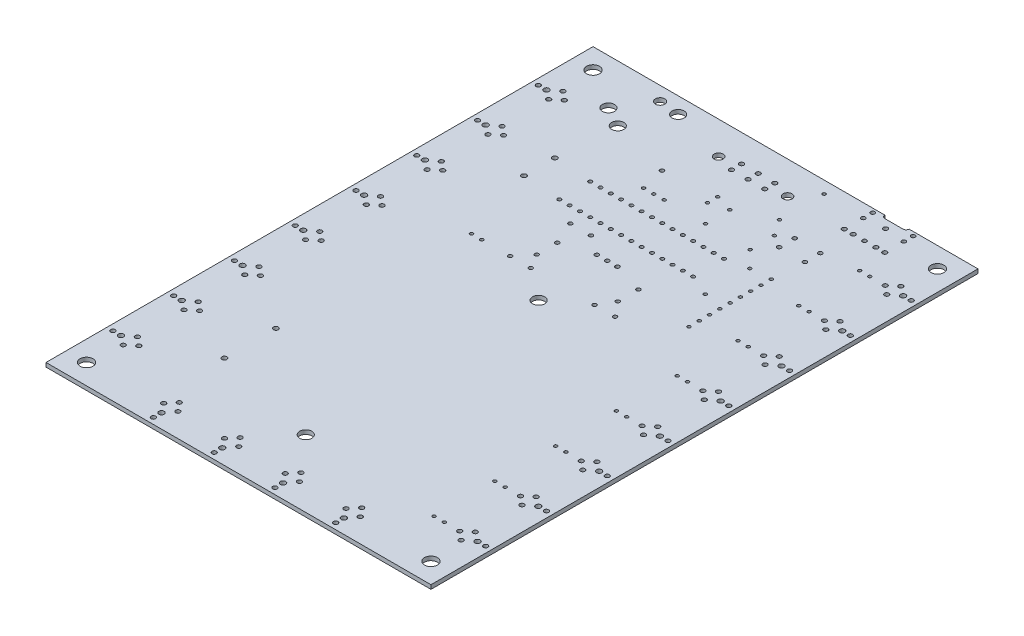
from build123d import *

# Parameters (mm, degrees)
ESQUISSE1_R      = 0.55118
ESQUISSE1_R_2    = 0.65024
ESQUISSE1_R_3    = 0.59944
ESQUISSE1_R_4    = 1.50114
ESQUISSE1_R_5    = 0.50038
ESQUISSE1_R_6    = 0.4826
ESQUISSE1_R_7    = 1.15062
ESQUISSE1_R_8    = 1.6002
ESQUISSE1_R_9    = 0.44958
ESQUISSE1_R_10   = 0.39878
ESQUISSE1_R_11   = 1.09982
EXTRUSION1_DEPTH = 1


with BuildPart() as part:
    # Esquisse1 → Extrusion1 (new body)
    with BuildSketch(Plane(origin=(0, 0, 0), x_dir=(1, 0, 0), z_dir=(0, 1, 0))):
        with BuildLine():
            Line((72.74814, 134.2517), (77.24902, 134.2517))
            ThreePointArc((77.24902, 134.2517), (77.77850144, 134.470811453), (77.998319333, 135))
            Line((77.998319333, 135), (95, 135))
            Line((95, 135), (95, 0))
            Line((95, 0), (0, 0))
            Line((0, 0), (0, 135))
            Line((0, 135), (71.998840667, 135))
            ThreePointArc((71.998840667, 135), (72.21865856, 134.470811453), (72.74814, 134.2517))
        make_face()
        with Locations(Location((24.99868, 1.4986, 0), (0, 0, 270))):
            Circle(ESQUISSE1_R, mode=Mode.SUBTRACT)
        with Locations(Location((24.99868, 7.8994, 0), (0, 0, 270))):
            Circle(ESQUISSE1_R, mode=Mode.SUBTRACT)
        with Locations(Location((26.74874, 5.79882, 0), (0, 0, 270))):
            Circle(ESQUISSE1_R, mode=Mode.SUBTRACT)
        with Locations(Location((23.24862, 5.79882, 0), (0, 0, 270))):
            Circle(ESQUISSE1_R, mode=Mode.SUBTRACT)
        with Locations(Location((24.99868, 3.50012, 0), (0, 0, 270))):
            Circle(ESQUISSE1_R_2, mode=Mode.SUBTRACT)
        with Locations(Location((39.99992, 1.4986, 0), (0, 0, 270))):
            Circle(ESQUISSE1_R, mode=Mode.SUBTRACT)
        with Locations(Location((39.99992, 7.8994, 0), (0, 0, 270))):
            Circle(ESQUISSE1_R, mode=Mode.SUBTRACT)
        with Locations(Location((41.74998, 5.79882, 0), (0, 0, 270))):
            Circle(ESQUISSE1_R, mode=Mode.SUBTRACT)
        with Locations(Location((38.24986, 5.79882, 0), (0, 0, 270))):
            Circle(ESQUISSE1_R, mode=Mode.SUBTRACT)
        with Locations(Location((39.99992, 3.50012, 0), (0, 0, 270))):
            Circle(ESQUISSE1_R_2, mode=Mode.SUBTRACT)
        with Locations(Location((54.99862, 1.4986, 0), (0, 0, 270))):
            Circle(ESQUISSE1_R, mode=Mode.SUBTRACT)
        with Locations(Location((54.99862, 7.8994, 0), (0, 0, 270))):
            Circle(ESQUISSE1_R, mode=Mode.SUBTRACT)
        with Locations(Location((56.74868, 5.79882, 0), (0, 0, 270))):
            Circle(ESQUISSE1_R, mode=Mode.SUBTRACT)
        with Locations(Location((53.24856, 5.79882, 0), (0, 0, 270))):
            Circle(ESQUISSE1_R, mode=Mode.SUBTRACT)
        with Locations(Location((54.99862, 3.50012, 0), (0, 0, 270))):
            Circle(ESQUISSE1_R_2, mode=Mode.SUBTRACT)
        with Locations(Location((69.99986, 1.4986, 0), (0, 0, 270))):
            Circle(ESQUISSE1_R, mode=Mode.SUBTRACT)
        with Locations(Location((69.99986, 7.8994, 0), (0, 0, 270))):
            Circle(ESQUISSE1_R, mode=Mode.SUBTRACT)
        with Locations(Location((71.74992, 5.79882, 0), (0, 0, 270))):
            Circle(ESQUISSE1_R, mode=Mode.SUBTRACT)
        with Locations(Location((68.2498, 5.79882, 0), (0, 0, 270))):
            Circle(ESQUISSE1_R, mode=Mode.SUBTRACT)
        with Locations(Location((69.99986, 3.50012, 0), (0, 0, 270))):
            Circle(ESQUISSE1_R_2, mode=Mode.SUBTRACT)
        with Locations(Location((21.07946, 35.6489, 0), (0, 0, 270))):
            Circle(ESQUISSE1_R_3, mode=Mode.SUBTRACT)
        with Locations(Location((21.07946, 22.9489, 0), (0, 0, 270))):
            Circle(ESQUISSE1_R_3, mode=Mode.SUBTRACT)
        with Locations(Location((47.50054, 16.5989, 0), (0, 0, 270))):
            Circle(ESQUISSE1_R_4, mode=Mode.SUBTRACT)
        with Locations(Location((72.1741, 118.90502, 0), (0, 0, 270))):
            Circle(ESQUISSE1_R_5, mode=Mode.SUBTRACT)
        with Locations(Location((72.1741, 115.09502, 0), (0, 0, 270))):
            Circle(ESQUISSE1_R_5, mode=Mode.SUBTRACT)
        with Locations(Location((65.8241, 115.09502, 0), (0, 0, 270))):
            Circle(ESQUISSE1_R_5, mode=Mode.SUBTRACT)
        with Locations(Location((65.8241, 118.90502, 0), (0, 0, 270))):
            Circle(ESQUISSE1_R_5, mode=Mode.SUBTRACT)
        with Locations(Location((40.0939, 94.3864, 0), (0, 0, 270))):
            Circle(ESQUISSE1_R_6, mode=Mode.SUBTRACT)
        with Locations(Location((35.0139, 94.3864, 0), (0, 0, 270))):
            Circle(ESQUISSE1_R_6, mode=Mode.SUBTRACT)
        with Locations(Location((60.452, 79.99222, 0), (0, 0, 270))):
            Circle(ESQUISSE1_R_6, mode=Mode.SUBTRACT)
        with Locations(Location((55.372, 79.99222, 0), (0, 0, 270))):
            Circle(ESQUISSE1_R_6, mode=Mode.SUBTRACT)
        with Locations(Location((34.54654, 80.00746, 0), (0, 0, 270))):
            Circle(ESQUISSE1_R_6, mode=Mode.SUBTRACT)
        with Locations(Location((39.62654, 80.00746, 0), (0, 0, 270))):
            Circle(ESQUISSE1_R_6, mode=Mode.SUBTRACT)
        with Locations(Location((57.50052, 83.59902, 0), (0, 0, 270))):
            Circle(ESQUISSE1_R_6, mode=Mode.SUBTRACT)
        with Locations(Location((57.50052, 88.67902, 0), (0, 0, 270))):
            Circle(ESQUISSE1_R_6, mode=Mode.SUBTRACT)
        with Locations(Location((37.50056, 83.59902, 0), (0, 0, 270))):
            Circle(ESQUISSE1_R_6, mode=Mode.SUBTRACT)
        with Locations(Location((37.50056, 88.67902, 0), (0, 0, 270))):
            Circle(ESQUISSE1_R_6, mode=Mode.SUBTRACT)
        with Locations(Location((19.99996, 121.09958, 0), (0, 0, 270))):
            Circle(ESQUISSE1_R_4, mode=Mode.SUBTRACT)
        with Locations(Location((15.00124, 123.7996, 0), (0, 0, 270))):
            Circle(ESQUISSE1_R_4, mode=Mode.SUBTRACT)
        with Locations(Location((25.00122, 131.0005, 0), (0, 0, 270))):
            Circle(ESQUISSE1_R_4, mode=Mode.SUBTRACT)
        with Locations(Location((19.99996, 131.54914, 0), (0, 0, 270))):
            Circle(ESQUISSE1_R_7, mode=Mode.SUBTRACT)
        with Locations(Location((19.07032, 98.8822, 0), (0, 0, 270))):
            Circle(ESQUISSE1_R_3, mode=Mode.SUBTRACT)
        with Locations(Location((19.07032, 106.5022, 0), (0, 0, 270))):
            Circle(ESQUISSE1_R_3, mode=Mode.SUBTRACT)
        with Locations(Location((5.00126, 5.00126, 0), (0, 0, 270))):
            Circle(ESQUISSE1_R_8, mode=Mode.SUBTRACT)
        with Locations(Location((5.00126, 129.99974, 0), (0, 0, 270))):
            Circle(ESQUISSE1_R_8, mode=Mode.SUBTRACT)
        with Locations(Location((89.99982, 129.99974, 0), (0, 0, 270))):
            Circle(ESQUISSE1_R_8, mode=Mode.SUBTRACT)
        with Locations(Location((89.99982, 5.00126, 0), (0, 0, 270))):
            Circle(ESQUISSE1_R_8, mode=Mode.SUBTRACT)
        with Locations(Location((61.51118, 105.80878, 0), (0, 0, 270))):
            Circle(ESQUISSE1_R_9, mode=Mode.SUBTRACT)
        with Locations(Location((58.97118, 105.80878, 0), (0, 0, 270))):
            Circle(ESQUISSE1_R_9, mode=Mode.SUBTRACT)
        with Locations(Location((56.43118, 105.80878, 0), (0, 0, 270))):
            Circle(ESQUISSE1_R_9, mode=Mode.SUBTRACT)
        with Locations(Location((53.89118, 105.80878, 0), (0, 0, 270))):
            Circle(ESQUISSE1_R_9, mode=Mode.SUBTRACT)
        with Locations(Location((51.35118, 105.80878, 0), (0, 0, 270))):
            Circle(ESQUISSE1_R_9, mode=Mode.SUBTRACT)
        with Locations(Location((48.81118, 105.80878, 0), (0, 0, 270))):
            Circle(ESQUISSE1_R_9, mode=Mode.SUBTRACT)
        with Locations(Location((46.27118, 105.80878, 0), (0, 0, 270))):
            Circle(ESQUISSE1_R_9, mode=Mode.SUBTRACT)
        with Locations(Location((43.73118, 105.80878, 0), (0, 0, 270))):
            Circle(ESQUISSE1_R_9, mode=Mode.SUBTRACT)
        with Locations(Location((41.19118, 105.80878, 0), (0, 0, 270))):
            Circle(ESQUISSE1_R_9, mode=Mode.SUBTRACT)
        with Locations(Location((38.65118, 105.80878, 0), (0, 0, 270))):
            Circle(ESQUISSE1_R_9, mode=Mode.SUBTRACT)
        with Locations(Location((36.11118, 105.80878, 0), (0, 0, 270))):
            Circle(ESQUISSE1_R_9, mode=Mode.SUBTRACT)
        with Locations(Location((33.57118, 105.80878, 0), (0, 0, 270))):
            Circle(ESQUISSE1_R_9, mode=Mode.SUBTRACT)
        with Locations(Location((31.03118, 105.80878, 0), (0, 0, 270))):
            Circle(ESQUISSE1_R_9, mode=Mode.SUBTRACT)
        with Locations(Location((28.49118, 105.80878, 0), (0, 0, 270))):
            Circle(ESQUISSE1_R_9, mode=Mode.SUBTRACT)
        with Locations(Location((28.49118, 98.18878, 0), (0, 0, 270))):
            Circle(ESQUISSE1_R_9, mode=Mode.SUBTRACT)
        with Locations(Location((31.03118, 98.18878, 0), (0, 0, 270))):
            Circle(ESQUISSE1_R_9, mode=Mode.SUBTRACT)
        with Locations(Location((33.57118, 98.18878, 0), (0, 0, 270))):
            Circle(ESQUISSE1_R_9, mode=Mode.SUBTRACT)
        with Locations(Location((36.11118, 98.18878, 0), (0, 0, 270))):
            Circle(ESQUISSE1_R_9, mode=Mode.SUBTRACT)
        with Locations(Location((38.65118, 98.18878, 0), (0, 0, 270))):
            Circle(ESQUISSE1_R_9, mode=Mode.SUBTRACT)
        with Locations(Location((41.19118, 98.18878, 0), (0, 0, 270))):
            Circle(ESQUISSE1_R_9, mode=Mode.SUBTRACT)
        with Locations(Location((43.73118, 98.18878, 0), (0, 0, 270))):
            Circle(ESQUISSE1_R_9, mode=Mode.SUBTRACT)
        with Locations(Location((46.27118, 98.18878, 0), (0, 0, 270))):
            Circle(ESQUISSE1_R_9, mode=Mode.SUBTRACT)
        with Locations(Location((48.81118, 98.18878, 0), (0, 0, 270))):
            Circle(ESQUISSE1_R_9, mode=Mode.SUBTRACT)
        with Locations(Location((51.35118, 98.18878, 0), (0, 0, 270))):
            Circle(ESQUISSE1_R_9, mode=Mode.SUBTRACT)
        with Locations(Location((53.89118, 98.18878, 0), (0, 0, 270))):
            Circle(ESQUISSE1_R_9, mode=Mode.SUBTRACT)
        with Locations(Location((56.43118, 98.18878, 0), (0, 0, 270))):
            Circle(ESQUISSE1_R_9, mode=Mode.SUBTRACT)
        with Locations(Location((58.97118, 98.18878, 0), (0, 0, 270))):
            Circle(ESQUISSE1_R_9, mode=Mode.SUBTRACT)
        with Locations(Location((61.51118, 98.18878, 0), (0, 0, 270))):
            Circle(ESQUISSE1_R_9, mode=Mode.SUBTRACT)
        with Locations(Location((1.4986, 15.00124, 0), (0, 0, 270))):
            Circle(ESQUISSE1_R, mode=Mode.SUBTRACT)
        with Locations(Location((7.8994, 15.00124, 0), (0, 0, 270))):
            Circle(ESQUISSE1_R, mode=Mode.SUBTRACT)
        with Locations(Location((5.79882, 13.25118, 0), (0, 0, 270))):
            Circle(ESQUISSE1_R, mode=Mode.SUBTRACT)
        with Locations(Location((5.79882, 16.7513, 0), (0, 0, 270))):
            Circle(ESQUISSE1_R, mode=Mode.SUBTRACT)
        with Locations(Location((3.50012, 15.00124, 0), (0, 0, 270))):
            Circle(ESQUISSE1_R_2, mode=Mode.SUBTRACT)
        with Locations(Location((1.4986, 29.99994, 0), (0, 0, 270))):
            Circle(ESQUISSE1_R, mode=Mode.SUBTRACT)
        with Locations(Location((7.8994, 29.99994, 0), (0, 0, 270))):
            Circle(ESQUISSE1_R, mode=Mode.SUBTRACT)
        with Locations(Location((5.79882, 28.24988, 0), (0, 0, 270))):
            Circle(ESQUISSE1_R, mode=Mode.SUBTRACT)
        with Locations(Location((5.79882, 31.75, 0), (0, 0, 270))):
            Circle(ESQUISSE1_R, mode=Mode.SUBTRACT)
        with Locations(Location((3.50012, 30.00248, 0), (0, 0, 270))):
            Circle(ESQUISSE1_R_2, mode=Mode.SUBTRACT)
        with Locations(Location((1.4986, 45.00118, 0), (0, 0, 270))):
            Circle(ESQUISSE1_R, mode=Mode.SUBTRACT)
        with Locations(Location((7.8994, 45.00118, 0), (0, 0, 270))):
            Circle(ESQUISSE1_R, mode=Mode.SUBTRACT)
        with Locations(Location((5.79882, 43.25112, 0), (0, 0, 270))):
            Circle(ESQUISSE1_R, mode=Mode.SUBTRACT)
        with Locations(Location((5.79882, 46.75124, 0), (0, 0, 270))):
            Circle(ESQUISSE1_R, mode=Mode.SUBTRACT)
        with Locations(Location((3.50012, 45.00118, 0), (0, 0, 270))):
            Circle(ESQUISSE1_R_2, mode=Mode.SUBTRACT)
        with Locations(Location((1.4986, 59.99988, 0), (0, 0, 270))):
            Circle(ESQUISSE1_R, mode=Mode.SUBTRACT)
        with Locations(Location((7.8994, 59.99988, 0), (0, 0, 270))):
            Circle(ESQUISSE1_R, mode=Mode.SUBTRACT)
        with Locations(Location((5.79882, 58.24982, 0), (0, 0, 270))):
            Circle(ESQUISSE1_R, mode=Mode.SUBTRACT)
        with Locations(Location((5.79882, 61.74994, 0), (0, 0, 270))):
            Circle(ESQUISSE1_R, mode=Mode.SUBTRACT)
        with Locations(Location((3.50012, 60.00242, 0), (0, 0, 270))):
            Circle(ESQUISSE1_R_2, mode=Mode.SUBTRACT)
        with Locations(Location((1.4986, 75.00112, 0), (0, 0, 270))):
            Circle(ESQUISSE1_R, mode=Mode.SUBTRACT)
        with Locations(Location((7.8994, 75.00112, 0), (0, 0, 270))):
            Circle(ESQUISSE1_R, mode=Mode.SUBTRACT)
        with Locations(Location((5.79882, 73.25106, 0), (0, 0, 270))):
            Circle(ESQUISSE1_R, mode=Mode.SUBTRACT)
        with Locations(Location((5.79882, 76.75118, 0), (0, 0, 270))):
            Circle(ESQUISSE1_R, mode=Mode.SUBTRACT)
        with Locations(Location((3.50012, 75.00112, 0), (0, 0, 270))):
            Circle(ESQUISSE1_R_2, mode=Mode.SUBTRACT)
        with Locations(Location((1.4986, 89.99982, 0), (0, 0, 270))):
            Circle(ESQUISSE1_R, mode=Mode.SUBTRACT)
        with Locations(Location((7.8994, 89.99982, 0), (0, 0, 270))):
            Circle(ESQUISSE1_R, mode=Mode.SUBTRACT)
        with Locations(Location((5.79882, 88.24976, 0), (0, 0, 270))):
            Circle(ESQUISSE1_R, mode=Mode.SUBTRACT)
        with Locations(Location((5.79882, 91.74988, 0), (0, 0, 270))):
            Circle(ESQUISSE1_R, mode=Mode.SUBTRACT)
        with Locations(Location((3.50012, 90.00236, 0), (0, 0, 270))):
            Circle(ESQUISSE1_R_2, mode=Mode.SUBTRACT)
        with Locations(Location((1.4986, 105.00106, 0), (0, 0, 270))):
            Circle(ESQUISSE1_R, mode=Mode.SUBTRACT)
        with Locations(Location((7.8994, 105.00106, 0), (0, 0, 270))):
            Circle(ESQUISSE1_R, mode=Mode.SUBTRACT)
        with Locations(Location((5.79882, 103.251, 0), (0, 0, 270))):
            Circle(ESQUISSE1_R, mode=Mode.SUBTRACT)
        with Locations(Location((5.79882, 106.75112, 0), (0, 0, 270))):
            Circle(ESQUISSE1_R, mode=Mode.SUBTRACT)
        with Locations(Location((3.50012, 105.00106, 0), (0, 0, 270))):
            Circle(ESQUISSE1_R_2, mode=Mode.SUBTRACT)
        with Locations(Location((1.4986, 119.99976, 0), (0, 0, 270))):
            Circle(ESQUISSE1_R, mode=Mode.SUBTRACT)
        with Locations(Location((7.8994, 119.99976, 0), (0, 0, 270))):
            Circle(ESQUISSE1_R, mode=Mode.SUBTRACT)
        with Locations(Location((5.79882, 118.25224, 0), (0, 0, 270))):
            Circle(ESQUISSE1_R, mode=Mode.SUBTRACT)
        with Locations(Location((5.79882, 121.74982, 0), (0, 0, 270))):
            Circle(ESQUISSE1_R, mode=Mode.SUBTRACT)
        with Locations(Location((3.50012, 120.0023, 0), (0, 0, 270))):
            Circle(ESQUISSE1_R_2, mode=Mode.SUBTRACT)
        with Locations(Location((25.00122, 79.99984, 0), (0, 0, 270))):
            Circle(ESQUISSE1_R_10, mode=Mode.SUBTRACT)
        with Locations(Location((27.54122, 79.99984, 0), (0, 0, 270))):
            Circle(ESQUISSE1_R_10, mode=Mode.SUBTRACT)
        with Locations(Location((74.99858, 132.19176, 0), (0, 0, 270))):
            Circle(ESQUISSE1_R, mode=Mode.SUBTRACT)
        with Locations(Location((79.9973, 126.99238, 0), (0, 0, 270))):
            Circle(ESQUISSE1_R, mode=Mode.SUBTRACT)
        with Locations(Location((77.79766, 126.99238, 0), (0, 0, 270))):
            Circle(ESQUISSE1_R, mode=Mode.SUBTRACT)
        with Locations(Location((72.19696, 126.99238, 0), (0, 0, 270))):
            Circle(ESQUISSE1_R, mode=Mode.SUBTRACT)
        with Locations(Location((69.99732, 126.99238, 0), (0, 0, 270))):
            Circle(ESQUISSE1_R, mode=Mode.SUBTRACT)
        with Locations(Location((74.99858, 126.99238, 0), (0, 0, 270))):
            Circle(ESQUISSE1_R_5, mode=Mode.SUBTRACT)
        with Locations(Location((79.9973, 133.99262, 0), (0, 0, 270))):
            Circle(ESQUISSE1_R_5, mode=Mode.SUBTRACT)
        with Locations(Location((79.9973, 131.69138, 0), (0, 0, 270))):
            Circle(ESQUISSE1_R_5, mode=Mode.SUBTRACT)
        with Locations(Location((69.99732, 133.99262, 0), (0, 0, 270))):
            Circle(ESQUISSE1_R_5, mode=Mode.SUBTRACT)
        with Locations(Location((69.99732, 131.69138, 0), (0, 0, 270))):
            Circle(ESQUISSE1_R_5, mode=Mode.SUBTRACT)
        with Locations(Location((83.28914, 15.01902, 0), (0, 0, 270))):
            Circle(ESQUISSE1_R_10, mode=Mode.SUBTRACT)
        with Locations(Location((80.74914, 15.01902, 0), (0, 0, 270))):
            Circle(ESQUISSE1_R_10, mode=Mode.SUBTRACT)
        with Locations(Location((83.28914, 30.01772, 0), (0, 0, 270))):
            Circle(ESQUISSE1_R_10, mode=Mode.SUBTRACT)
        with Locations(Location((80.74914, 30.01772, 0), (0, 0, 270))):
            Circle(ESQUISSE1_R_10, mode=Mode.SUBTRACT)
        with Locations(Location((83.28914, 45.01896, 0), (0, 0, 270))):
            Circle(ESQUISSE1_R_10, mode=Mode.SUBTRACT)
        with Locations(Location((80.74914, 45.01896, 0), (0, 0, 270))):
            Circle(ESQUISSE1_R_10, mode=Mode.SUBTRACT)
        with Locations(Location((83.28914, 60.01766, 0), (0, 0, 270))):
            Circle(ESQUISSE1_R_10, mode=Mode.SUBTRACT)
        with Locations(Location((80.74914, 60.01766, 0), (0, 0, 270))):
            Circle(ESQUISSE1_R_10, mode=Mode.SUBTRACT)
        with Locations(Location((83.28914, 75.0189, 0), (0, 0, 270))):
            Circle(ESQUISSE1_R_10, mode=Mode.SUBTRACT)
        with Locations(Location((80.74914, 75.0189, 0), (0, 0, 270))):
            Circle(ESQUISSE1_R_10, mode=Mode.SUBTRACT)
        with Locations(Location((83.28914, 90.0176, 0), (0, 0, 270))):
            Circle(ESQUISSE1_R_10, mode=Mode.SUBTRACT)
        with Locations(Location((80.74914, 90.0176, 0), (0, 0, 270))):
            Circle(ESQUISSE1_R_10, mode=Mode.SUBTRACT)
        with Locations(Location((83.28914, 105.01884, 0), (0, 0, 270))):
            Circle(ESQUISSE1_R_10, mode=Mode.SUBTRACT)
        with Locations(Location((80.74914, 105.01884, 0), (0, 0, 270))):
            Circle(ESQUISSE1_R_10, mode=Mode.SUBTRACT)
        with Locations(Location((83.28914, 120.01754, 0), (0, 0, 270))):
            Circle(ESQUISSE1_R_10, mode=Mode.SUBTRACT)
        with Locations(Location((80.74914, 120.01754, 0), (0, 0, 270))):
            Circle(ESQUISSE1_R_10, mode=Mode.SUBTRACT)
        with Locations(Location((47.50054, 115.73002, 0), (0, 0, 270))):
            Circle(ESQUISSE1_R_10, mode=Mode.SUBTRACT)
        with Locations(Location((47.50054, 118.27002, 0), (0, 0, 270))):
            Circle(ESQUISSE1_R_10, mode=Mode.SUBTRACT)
        with Locations(Location((93.49994, 14.9987, 0), (0, 0, 270))):
            Circle(ESQUISSE1_R, mode=Mode.SUBTRACT)
        with Locations(Location((87.10168, 14.9987, 0), (0, 0, 270))):
            Circle(ESQUISSE1_R, mode=Mode.SUBTRACT)
        with Locations(Location((89.20226, 16.74876, 0), (0, 0, 270))):
            Circle(ESQUISSE1_R, mode=Mode.SUBTRACT)
        with Locations(Location((89.20226, 13.24864, 0), (0, 0, 270))):
            Circle(ESQUISSE1_R, mode=Mode.SUBTRACT)
        with Locations(Location((91.50096, 14.9987, 0), (0, 0, 270))):
            Circle(ESQUISSE1_R_2, mode=Mode.SUBTRACT)
        with Locations(Location((93.49994, 29.99994, 0), (0, 0, 270))):
            Circle(ESQUISSE1_R, mode=Mode.SUBTRACT)
        with Locations(Location((87.10168, 29.99994, 0), (0, 0, 270))):
            Circle(ESQUISSE1_R, mode=Mode.SUBTRACT)
        with Locations(Location((89.20226, 31.75, 0), (0, 0, 270))):
            Circle(ESQUISSE1_R, mode=Mode.SUBTRACT)
        with Locations(Location((89.20226, 28.24988, 0), (0, 0, 270))):
            Circle(ESQUISSE1_R, mode=Mode.SUBTRACT)
        with Locations(Location((91.50096, 29.99994, 0), (0, 0, 270))):
            Circle(ESQUISSE1_R_2, mode=Mode.SUBTRACT)
        with Locations(Location((93.49994, 44.99864, 0), (0, 0, 270))):
            Circle(ESQUISSE1_R, mode=Mode.SUBTRACT)
        with Locations(Location((87.10168, 44.99864, 0), (0, 0, 270))):
            Circle(ESQUISSE1_R, mode=Mode.SUBTRACT)
        with Locations(Location((89.20226, 46.7487, 0), (0, 0, 270))):
            Circle(ESQUISSE1_R, mode=Mode.SUBTRACT)
        with Locations(Location((89.20226, 43.24858, 0), (0, 0, 270))):
            Circle(ESQUISSE1_R, mode=Mode.SUBTRACT)
        with Locations(Location((91.50096, 44.99864, 0), (0, 0, 270))):
            Circle(ESQUISSE1_R_2, mode=Mode.SUBTRACT)
        with Locations(Location((93.49994, 59.99988, 0), (0, 0, 270))):
            Circle(ESQUISSE1_R, mode=Mode.SUBTRACT)
        with Locations(Location((87.10168, 59.99988, 0), (0, 0, 270))):
            Circle(ESQUISSE1_R, mode=Mode.SUBTRACT)
        with Locations(Location((89.20226, 61.74994, 0), (0, 0, 270))):
            Circle(ESQUISSE1_R, mode=Mode.SUBTRACT)
        with Locations(Location((89.20226, 58.24982, 0), (0, 0, 270))):
            Circle(ESQUISSE1_R, mode=Mode.SUBTRACT)
        with Locations(Location((91.50096, 59.99988, 0), (0, 0, 270))):
            Circle(ESQUISSE1_R_2, mode=Mode.SUBTRACT)
        with Locations(Location((93.49994, 74.99858, 0), (0, 0, 270))):
            Circle(ESQUISSE1_R, mode=Mode.SUBTRACT)
        with Locations(Location((87.10168, 74.99858, 0), (0, 0, 270))):
            Circle(ESQUISSE1_R, mode=Mode.SUBTRACT)
        with Locations(Location((89.20226, 76.74864, 0), (0, 0, 270))):
            Circle(ESQUISSE1_R, mode=Mode.SUBTRACT)
        with Locations(Location((89.20226, 73.24852, 0), (0, 0, 270))):
            Circle(ESQUISSE1_R, mode=Mode.SUBTRACT)
        with Locations(Location((91.50096, 74.99858, 0), (0, 0, 270))):
            Circle(ESQUISSE1_R_2, mode=Mode.SUBTRACT)
        with Locations(Location((93.49994, 89.99982, 0), (0, 0, 270))):
            Circle(ESQUISSE1_R, mode=Mode.SUBTRACT)
        with Locations(Location((87.10168, 89.99982, 0), (0, 0, 270))):
            Circle(ESQUISSE1_R, mode=Mode.SUBTRACT)
        with Locations(Location((89.20226, 91.74988, 0), (0, 0, 270))):
            Circle(ESQUISSE1_R, mode=Mode.SUBTRACT)
        with Locations(Location((89.20226, 88.24976, 0), (0, 0, 270))):
            Circle(ESQUISSE1_R, mode=Mode.SUBTRACT)
        with Locations(Location((91.50096, 89.99982, 0), (0, 0, 270))):
            Circle(ESQUISSE1_R_2, mode=Mode.SUBTRACT)
        with Locations(Location((93.49994, 104.99852, 0), (0, 0, 270))):
            Circle(ESQUISSE1_R, mode=Mode.SUBTRACT)
        with Locations(Location((87.10168, 104.99852, 0), (0, 0, 270))):
            Circle(ESQUISSE1_R, mode=Mode.SUBTRACT)
        with Locations(Location((89.20226, 106.74858, 0), (0, 0, 270))):
            Circle(ESQUISSE1_R, mode=Mode.SUBTRACT)
        with Locations(Location((89.20226, 103.24846, 0), (0, 0, 270))):
            Circle(ESQUISSE1_R, mode=Mode.SUBTRACT)
        with Locations(Location((91.50096, 104.99852, 0), (0, 0, 270))):
            Circle(ESQUISSE1_R_2, mode=Mode.SUBTRACT)
        with Locations(Location((93.49994, 119.99976, 0), (0, 0, 270))):
            Circle(ESQUISSE1_R, mode=Mode.SUBTRACT)
        with Locations(Location((87.10168, 119.99976, 0), (0, 0, 270))):
            Circle(ESQUISSE1_R, mode=Mode.SUBTRACT)
        with Locations(Location((89.20226, 121.74982, 0), (0, 0, 270))):
            Circle(ESQUISSE1_R, mode=Mode.SUBTRACT)
        with Locations(Location((89.20226, 118.2497, 0), (0, 0, 270))):
            Circle(ESQUISSE1_R, mode=Mode.SUBTRACT)
        with Locations(Location((91.50096, 119.99976, 0), (0, 0, 270))):
            Circle(ESQUISSE1_R_2, mode=Mode.SUBTRACT)
        with Locations(Location((36.45916, 111.00054, 0), (0, 0, 270))):
            Circle(ESQUISSE1_R_10, mode=Mode.SUBTRACT)
        with Locations(Location((38.99916, 111.00054, 0), (0, 0, 270))):
            Circle(ESQUISSE1_R_10, mode=Mode.SUBTRACT)
        with Locations(Location((41.53916, 111.00054, 0), (0, 0, 270))):
            Circle(ESQUISSE1_R_10, mode=Mode.SUBTRACT)
        with Locations(Location((66.76136, 95.92818, 0), (0, 0, 270))):
            Circle(ESQUISSE1_R_10, mode=Mode.SUBTRACT)
        with Locations(Location((66.76136, 106.92892, 0), (0, 0, 270))):
            Circle(ESQUISSE1_R_10, mode=Mode.SUBTRACT)
        with Locations(Location((59.99988, 121.00052, 0), (0, 0, 270))):
            Circle(ESQUISSE1_R_10, mode=Mode.SUBTRACT)
        with Locations(Location((59.99988, 132.00126, 0), (0, 0, 270))):
            Circle(ESQUISSE1_R_10, mode=Mode.SUBTRACT)
        with Locations(Location((51.74996, 117.00002, 0), (0, 0, 270))):
            Circle(ESQUISSE1_R_10, mode=Mode.SUBTRACT)
        with Locations(Location((62.7507, 117.00002, 0), (0, 0, 270))):
            Circle(ESQUISSE1_R_10, mode=Mode.SUBTRACT)
        with Locations(Location((62.7507, 111.00054, 0), (0, 0, 270))):
            Circle(ESQUISSE1_R_10, mode=Mode.SUBTRACT)
        with Locations(Location((51.74996, 111.00054, 0), (0, 0, 270))):
            Circle(ESQUISSE1_R_10, mode=Mode.SUBTRACT)
        with Locations(Location((50.04054, 90.97518, 0), (0, 0, 270))):
            Circle(ESQUISSE1_R_5, mode=Mode.SUBTRACT)
        with Locations(Location((47.50054, 90.97518, 0), (0, 0, 270))):
            Circle(ESQUISSE1_R_5, mode=Mode.SUBTRACT)
        with Locations(Location((44.96054, 90.97518, 0), (0, 0, 270))):
            Circle(ESQUISSE1_R_5, mode=Mode.SUBTRACT)
        with Locations(Location((47.50054, 74.07402, 0), (0, 0, 270))):
            Circle(ESQUISSE1_R_4, mode=Mode.SUBTRACT)
        with Locations(Location((71.69912, 86.96706, 0), (0, 0, 270))):
            Circle(ESQUISSE1_R_10, mode=Mode.SUBTRACT)
        with Locations(Location((71.69912, 89.50706, 0), (0, 0, 270))):
            Circle(ESQUISSE1_R_10, mode=Mode.SUBTRACT)
        with Locations(Location((71.69912, 92.04706, 0), (0, 0, 270))):
            Circle(ESQUISSE1_R_10, mode=Mode.SUBTRACT)
        with Locations(Location((71.69912, 94.58706, 0), (0, 0, 270))):
            Circle(ESQUISSE1_R_10, mode=Mode.SUBTRACT)
        with Locations(Location((71.69912, 97.12706, 0), (0, 0, 270))):
            Circle(ESQUISSE1_R_10, mode=Mode.SUBTRACT)
        with Locations(Location((71.69912, 99.66706, 0), (0, 0, 270))):
            Circle(ESQUISSE1_R_10, mode=Mode.SUBTRACT)
        with Locations(Location((71.69912, 102.20706, 0), (0, 0, 270))):
            Circle(ESQUISSE1_R_10, mode=Mode.SUBTRACT)
        with Locations(Location((71.69912, 104.74706, 0), (0, 0, 270))):
            Circle(ESQUISSE1_R_10, mode=Mode.SUBTRACT)
        with Locations(Location((71.69912, 107.28706, 0), (0, 0, 270))):
            Circle(ESQUISSE1_R_10, mode=Mode.SUBTRACT)
        with Locations(Location((47.50054, 128.24968, 0), (0, 0, 270))):
            Circle(ESQUISSE1_R, mode=Mode.SUBTRACT)
        with Locations(Location((43.40098, 128.24968, 0), (0, 0, 270))):
            Circle(ESQUISSE1_R, mode=Mode.SUBTRACT)
        with Locations(Location((47.50054, 125.75032, 0), (0, 0, 270))):
            Circle(ESQUISSE1_R, mode=Mode.SUBTRACT)
        with Locations(Location((43.40098, 125.75032, 0), (0, 0, 270))):
            Circle(ESQUISSE1_R, mode=Mode.SUBTRACT)
        with Locations(Location((51.6001, 128.24968, 0), (0, 0, 270))):
            Circle(ESQUISSE1_R, mode=Mode.SUBTRACT)
        with Locations(Location((51.6001, 125.75032, 0), (0, 0, 270))):
            Circle(ESQUISSE1_R, mode=Mode.SUBTRACT)
        with Locations(Location((55.99938, 127, 0), (0, 0, 270))):
            Circle(ESQUISSE1_R_11, mode=Mode.SUBTRACT)
        with Locations(Location((38.99916, 127, 0), (0, 0, 270))):
            Circle(ESQUISSE1_R_11, mode=Mode.SUBTRACT)
        with Locations(Location((35.0012, 117.00002, 0), (0, 0, 270))):
            Circle(ESQUISSE1_R_5, mode=Mode.SUBTRACT)
    extrude(amount=EXTRUSION1_DEPTH)


solid = part.part
